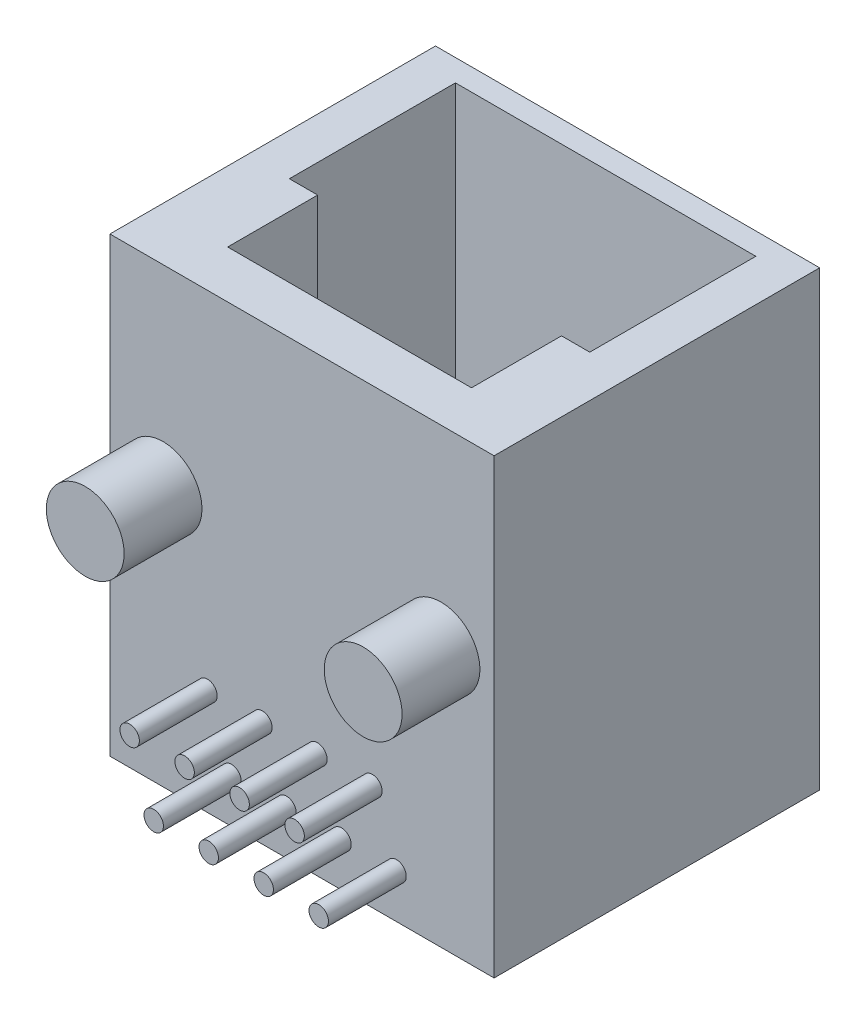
from build123d import *

# Parameters (mm, degrees)
SKETCH1_W           = 15.8
SKETCH1_H           = 13.39
BOSS_EXTRUDE1_DEPTH = 18.6
CUT_EXTRUDE1_DEPTH  = 14.6
SKETCH3_R           = 1.6
SKETCH3_R_2         = 0.4
BOSS_EXTRUDE2_DEPTH = 3.2


with BuildPart() as part:
    # Sketch1 → Boss-Extrude1 (new body)
    with BuildSketch(Plane(origin=(0, 0, 0), x_dir=(1, 0, 0), z_dir=(0, 1, 0))):
        Rectangle(SKETCH1_W, SKETCH1_H)
    extrude(amount=BOSS_EXTRUDE1_DEPTH)

    # Sketch2 → Cut-Extrude1 (cut)
    with BuildSketch(Plane(origin=(0, 18.6, 0), x_dir=(1, 0, 0), z_dir=(0, 1, 0))):
        Polygon((5.014873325, -1.036943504), (6.176965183, -1.036943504), (6.176965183, 5.792580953), (-6.176965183, 5.792580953), (-6.176965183, -1.036943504), (-5.014873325, -1.036943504), (-5.014873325, -4.737759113), (5.014873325, -4.737759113), align=None)
    extrude(amount=-CUT_EXTRUDE1_DEPTH, mode=Mode.SUBTRACT)

    # Sketch3 → Boss-Extrude2 (add)
    with BuildSketch(Plane.XY.offset(6.695)):
        with Locations(Location((-5.715, 10.7, 0), (0, 0, 180))):
            Circle(SKETCH3_R)
        with Locations(Location((5.715, 10.7, 0), (0, 0, 180))):
            Circle(SKETCH3_R)
        with Locations(Location((2.89599, 4.35, 0), (0, 0, 180))):
            Circle(SKETCH3_R_2)
        with Locations(Location((0.63401, 4.35, 0), (0, 0, 180))):
            Circle(SKETCH3_R_2)
        with Locations(Location((-1.62797, 4.35, 0), (0, 0, 180))):
            Circle(SKETCH3_R_2)
        with Locations(Location((3.88797, 1.81, 0), (0, 0, 180))):
            Circle(SKETCH3_R_2)
        with Locations(Location((1.62599, 1.81, 0), (0, 0, 180))):
            Circle(SKETCH3_R_2)
        with Locations(Location((-0.63599, 1.81, 0), (0, 0, 180))):
            Circle(SKETCH3_R_2)
        with Locations(Location((-2.89797, 1.81, 0), (0, 0, 180))):
            Circle(SKETCH3_R_2)
        with Locations(Location((-3.88797, 4.35, 0), (0, 0, 180))):
            Circle(SKETCH3_R_2)
    extrude(amount=BOSS_EXTRUDE2_DEPTH)


solid = part.part
